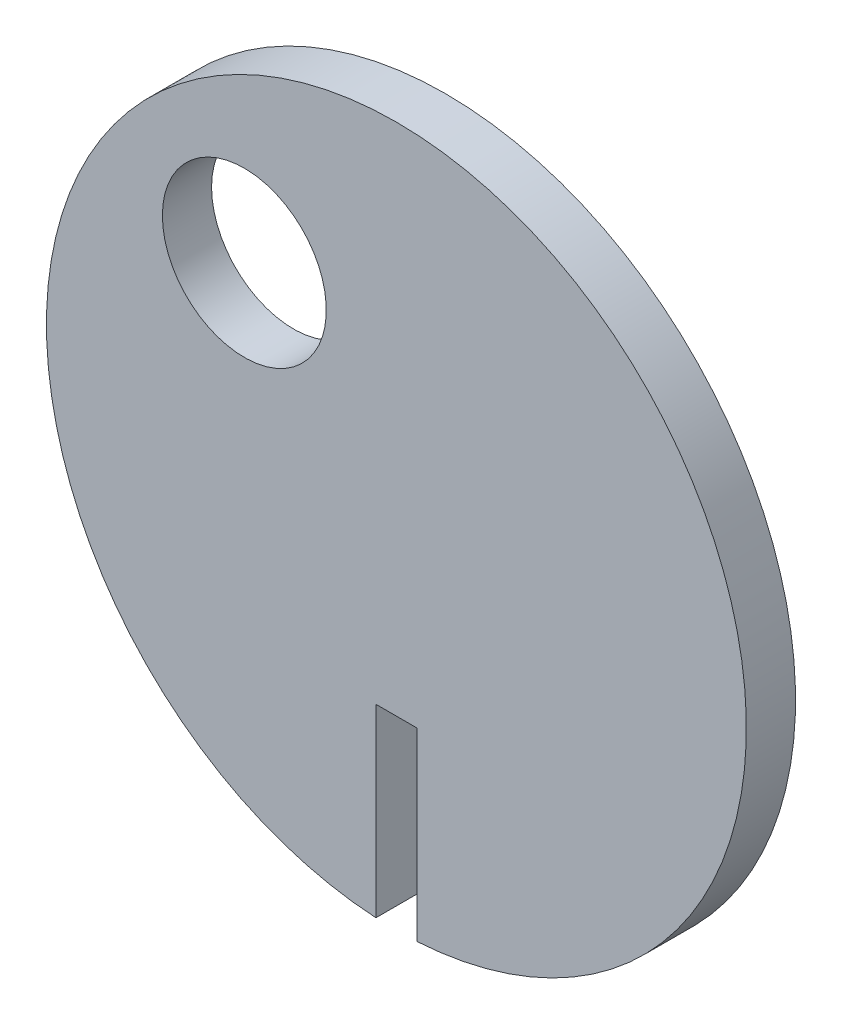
ISO-10303-21;
HEADER;
FILE_DESCRIPTION(('STEP AP214'),'2;1');
FILE_NAME('part.step','',(''),(''),'','','');
FILE_SCHEMA(('AUTOMOTIVE_DESIGN { 1 0 10303 214 1 1 1 1 }'));
ENDSEC;
DATA;
#1=APPLICATION_CONTEXT('core data for automotive mechanical design processes');
#2=APPLICATION_PROTOCOL_DEFINITION('international standard','automotive_design',2000,#1);
#3=PRODUCT_CONTEXT('',#1,'mechanical');
#4=PRODUCT('Part','Part','',(#3));
#5=PRODUCT_RELATED_PRODUCT_CATEGORY('part','',(#4));
#6=PRODUCT_DEFINITION_FORMATION('','',#4);
#7=PRODUCT_DEFINITION_CONTEXT('part definition',#1,'design');
#8=PRODUCT_DEFINITION('design','',#6,#7);
#9=PRODUCT_DEFINITION_SHAPE('','',#8);
#10=(LENGTH_UNIT() NAMED_UNIT(*) SI_UNIT(.MILLI.,.METRE.));
#11=(NAMED_UNIT(*) PLANE_ANGLE_UNIT() SI_UNIT($,.RADIAN.));
#12=(NAMED_UNIT(*) SI_UNIT($,.STERADIAN.) SOLID_ANGLE_UNIT());
#13=UNCERTAINTY_MEASURE_WITH_UNIT(LENGTH_MEASURE(1.E-05),#10,'distance_accuracy_value','');
#14=(GEOMETRIC_REPRESENTATION_CONTEXT(3) GLOBAL_UNCERTAINTY_ASSIGNED_CONTEXT((#13)) GLOBAL_UNIT_ASSIGNED_CONTEXT((#10,
#11,#12)) REPRESENTATION_CONTEXT('',''));
#15=CARTESIAN_POINT('',(0.,0.,0.));
#16=DIRECTION('',(0.,0.,1.));
#17=DIRECTION('',(1.,0.,0.));
#18=AXIS2_PLACEMENT_3D('',#15,#16,#17);
#19=CARTESIAN_POINT('',(0.,0.,3.81));
#20=DIRECTION('',(0.,0.,1.));
#21=DIRECTION('',(1.,0.,0.));
#22=AXIS2_PLACEMENT_3D('',#19,#20,#21);
#23=PLANE('',#22);
#24=CARTESIAN_POINT('',(-11.7820960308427,11.7820960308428,3.81));
#25=DIRECTION('',(0.,0.,1.));
#26=DIRECTION('',(1.,0.,0.));
#27=AXIS2_PLACEMENT_3D('',#24,#25,#26);
#28=CIRCLE('',#27,6.35);
#29=CARTESIAN_POINT('',(-18.1320960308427,11.7820960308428,3.81));
#30=VERTEX_POINT('',#29);
#31=EDGE_CURVE('E99',#30,#30,#28,.T.);
#32=ORIENTED_EDGE('',*,*,#31,.F.);
#33=EDGE_LOOP('',(#32));
#34=FACE_BOUND('',#33,.T.);
#35=CARTESIAN_POINT('',(0.,0.,3.81));
#36=DIRECTION('',(0.,0.,1.));
#37=DIRECTION('',(1.,0.,0.));
#38=AXIS2_PLACEMENT_3D('',#35,#36,#37);
#39=CIRCLE('',#38,27.1145);
#40=CARTESIAN_POINT('',(1.58750000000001,-27.0679876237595,3.81));
#41=VERTEX_POINT('',#40);
#42=CARTESIAN_POINT('',(-1.5875,-27.0679876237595,3.81));
#43=VERTEX_POINT('',#42);
#44=EDGE_CURVE('E103',#41,#43,#39,.T.);
#45=ORIENTED_EDGE('',*,*,#44,.T.);
#46=DIRECTION('',(0.,-1.,0.));
#47=VECTOR('',#46,1.);
#48=CARTESIAN_POINT('',(-1.5875,-12.7430596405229,3.81));
#49=LINE('',#48,#47);
#50=CARTESIAN_POINT('',(-1.5875,-12.7430596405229,3.81));
#51=VERTEX_POINT('',#50);
#52=EDGE_CURVE('E82',#51,#43,#49,.T.);
#53=ORIENTED_EDGE('',*,*,#52,.F.);
#54=DIRECTION('',(-1.,0.,0.));
#55=VECTOR('',#54,1.);
#56=CARTESIAN_POINT('',(-1.5875,-12.7430596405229,3.81));
#57=LINE('',#56,#55);
#58=CARTESIAN_POINT('',(1.58750000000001,-12.7430596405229,3.81));
#59=VERTEX_POINT('',#58);
#60=EDGE_CURVE('E94',#59,#51,#57,.T.);
#61=ORIENTED_EDGE('',*,*,#60,.F.);
#62=DIRECTION('',(0.,1.,0.));
#63=VECTOR('',#62,1.);
#64=CARTESIAN_POINT('',(1.58750000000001,-12.7430596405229,3.81));
#65=LINE('',#64,#63);
#66=EDGE_CURVE('E69',#41,#59,#65,.T.);
#67=ORIENTED_EDGE('',*,*,#66,.F.);
#68=EDGE_LOOP('',(#45,#53,#61,#67));
#69=FACE_BOUND('',#68,.T.);
#70=ADVANCED_FACE('F31',(#34,#69),#23,.T.);
#71=CARTESIAN_POINT('',(0.,0.,0.));
#72=DIRECTION('',(0.,0.,1.));
#73=DIRECTION('',(1.,0.,0.));
#74=AXIS2_PLACEMENT_3D('',#71,#72,#73);
#75=PLANE('',#74);
#76=CARTESIAN_POINT('',(-11.7820960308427,11.7820960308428,0.));
#77=DIRECTION('',(0.,0.,1.));
#78=DIRECTION('',(1.,0.,0.));
#79=AXIS2_PLACEMENT_3D('',#76,#77,#78);
#80=CIRCLE('',#79,6.35);
#81=CARTESIAN_POINT('',(-18.1320960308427,11.7820960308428,0.));
#82=VERTEX_POINT('',#81);
#83=EDGE_CURVE('E72',#82,#82,#80,.T.);
#84=ORIENTED_EDGE('',*,*,#83,.T.);
#85=EDGE_LOOP('',(#84));
#86=FACE_BOUND('',#85,.T.);
#87=DIRECTION('',(0.,-1.,0.));
#88=VECTOR('',#87,1.);
#89=CARTESIAN_POINT('',(-1.5875,-12.7430596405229,0.));
#90=LINE('',#89,#88);
#91=CARTESIAN_POINT('',(-1.5875,-12.7430596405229,0.));
#92=VERTEX_POINT('',#91);
#93=CARTESIAN_POINT('',(-1.5875,-27.0679876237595,0.));
#94=VERTEX_POINT('',#93);
#95=EDGE_CURVE('E88',#92,#94,#90,.T.);
#96=ORIENTED_EDGE('',*,*,#95,.T.);
#97=CARTESIAN_POINT('',(0.,0.,0.));
#98=DIRECTION('',(0.,0.,1.));
#99=DIRECTION('',(1.,0.,0.));
#100=AXIS2_PLACEMENT_3D('',#97,#98,#99);
#101=CIRCLE('',#100,27.1145);
#102=CARTESIAN_POINT('',(1.58750000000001,-27.0679876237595,0.));
#103=VERTEX_POINT('',#102);
#104=EDGE_CURVE('E87',#103,#94,#101,.T.);
#105=ORIENTED_EDGE('',*,*,#104,.F.);
#106=DIRECTION('',(0.,1.,0.));
#107=VECTOR('',#106,1.);
#108=CARTESIAN_POINT('',(1.58750000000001,-12.7430596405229,0.));
#109=LINE('',#108,#107);
#110=CARTESIAN_POINT('',(1.58750000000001,-12.7430596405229,0.));
#111=VERTEX_POINT('',#110);
#112=EDGE_CURVE('E46',#103,#111,#109,.T.);
#113=ORIENTED_EDGE('',*,*,#112,.T.);
#114=DIRECTION('',(-1.,0.,0.));
#115=VECTOR('',#114,1.);
#116=CARTESIAN_POINT('',(-1.5875,-12.7430596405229,0.));
#117=LINE('',#116,#115);
#118=EDGE_CURVE('E76',#111,#92,#117,.T.);
#119=ORIENTED_EDGE('',*,*,#118,.T.);
#120=EDGE_LOOP('',(#96,#105,#113,#119));
#121=FACE_BOUND('',#120,.T.);
#122=ADVANCED_FACE('F85',(#86,#121),#75,.F.);
#123=CARTESIAN_POINT('',(0.,0.,3.81));
#124=DIRECTION('',(0.,0.,-1.));
#125=DIRECTION('',(-1.,0.,0.));
#126=AXIS2_PLACEMENT_3D('',#123,#124,#125);
#127=CYLINDRICAL_SURFACE('',#126,27.1145);
#128=DIRECTION('',(0.,0.,-1.));
#129=VECTOR('',#128,1.);
#130=CARTESIAN_POINT('',(-1.58749999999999,-27.0679876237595,3.81));
#131=LINE('',#130,#129);
#132=EDGE_CURVE('E11',#43,#94,#131,.T.);
#133=ORIENTED_EDGE('',*,*,#132,.F.);
#134=ORIENTED_EDGE('',*,*,#44,.F.);
#135=DIRECTION('',(0.,0.,-1.));
#136=VECTOR('',#135,1.);
#137=CARTESIAN_POINT('',(1.5875,-27.0679876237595,3.81));
#138=LINE('',#137,#136);
#139=EDGE_CURVE('E39',#103,#41,#138,.F.);
#140=ORIENTED_EDGE('',*,*,#139,.F.);
#141=ORIENTED_EDGE('',*,*,#104,.T.);
#142=EDGE_LOOP('',(#133,#134,#140,#141));
#143=FACE_BOUND('',#142,.T.);
#144=ADVANCED_FACE('F33',(#143),#127,.T.);
#145=CARTESIAN_POINT('',(-11.7820960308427,11.7820960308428,3.81));
#146=DIRECTION('',(0.,0.,-1.));
#147=DIRECTION('',(-1.,0.,0.));
#148=AXIS2_PLACEMENT_3D('',#145,#146,#147);
#149=CYLINDRICAL_SURFACE('',#148,6.35);
#150=CARTESIAN_POINT('',(-18.1320960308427,11.7820960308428,3.81));
#151=CARTESIAN_POINT('',(-18.1320960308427,11.7820960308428,3.7703125));
#152=CARTESIAN_POINT('',(-18.1320960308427,11.7820960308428,3.730625));
#153=CARTESIAN_POINT('',(-18.1320960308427,11.7820960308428,3.65125));
#154=CARTESIAN_POINT('',(-18.1320960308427,11.7820960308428,3.6115625));
#155=CARTESIAN_POINT('',(-18.1320960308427,11.7820960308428,3.5321875));
#156=CARTESIAN_POINT('',(-18.1320960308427,11.7820960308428,3.4925));
#157=CARTESIAN_POINT('',(-18.1320960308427,11.7820960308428,3.413125));
#158=CARTESIAN_POINT('',(-18.1320960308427,11.7820960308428,3.3734375));
#159=CARTESIAN_POINT('',(-18.1320960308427,11.7820960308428,3.2940625));
#160=CARTESIAN_POINT('',(-18.1320960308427,11.7820960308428,3.254375));
#161=CARTESIAN_POINT('',(-18.1320960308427,11.7820960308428,3.175));
#162=CARTESIAN_POINT('',(-18.1320960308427,11.7820960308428,3.1353125));
#163=CARTESIAN_POINT('',(-18.1320960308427,11.7820960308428,3.0559375));
#164=CARTESIAN_POINT('',(-18.1320960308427,11.7820960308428,3.01625));
#165=CARTESIAN_POINT('',(-18.1320960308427,11.7820960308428,2.936875));
#166=CARTESIAN_POINT('',(-18.1320960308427,11.7820960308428,2.8971875));
#167=CARTESIAN_POINT('',(-18.1320960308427,11.7820960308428,2.8178125));
#168=CARTESIAN_POINT('',(-18.1320960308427,11.7820960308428,2.778125));
#169=CARTESIAN_POINT('',(-18.1320960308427,11.7820960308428,2.69875));
#170=CARTESIAN_POINT('',(-18.1320960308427,11.7820960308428,2.6590625));
#171=CARTESIAN_POINT('',(-18.1320960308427,11.7820960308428,2.5796875));
#172=CARTESIAN_POINT('',(-18.1320960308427,11.7820960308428,2.54));
#173=CARTESIAN_POINT('',(-18.1320960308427,11.7820960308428,2.460625));
#174=CARTESIAN_POINT('',(-18.1320960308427,11.7820960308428,2.4209375));
#175=CARTESIAN_POINT('',(-18.1320960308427,11.7820960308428,2.3415625));
#176=CARTESIAN_POINT('',(-18.1320960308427,11.7820960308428,2.301875));
#177=CARTESIAN_POINT('',(-18.1320960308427,11.7820960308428,2.2225));
#178=CARTESIAN_POINT('',(-18.1320960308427,11.7820960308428,2.1828125));
#179=CARTESIAN_POINT('',(-18.1320960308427,11.7820960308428,2.1034375));
#180=CARTESIAN_POINT('',(-18.1320960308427,11.7820960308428,2.06375));
#181=CARTESIAN_POINT('',(-18.1320960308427,11.7820960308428,1.984375));
#182=CARTESIAN_POINT('',(-18.1320960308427,11.7820960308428,1.9446875));
#183=CARTESIAN_POINT('',(-18.1320960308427,11.7820960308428,1.8653125));
#184=CARTESIAN_POINT('',(-18.1320960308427,11.7820960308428,1.825625));
#185=CARTESIAN_POINT('',(-18.1320960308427,11.7820960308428,1.74625));
#186=CARTESIAN_POINT('',(-18.1320960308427,11.7820960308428,1.7065625));
#187=CARTESIAN_POINT('',(-18.1320960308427,11.7820960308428,1.6271875));
#188=CARTESIAN_POINT('',(-18.1320960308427,11.7820960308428,1.5875));
#189=CARTESIAN_POINT('',(-18.1320960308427,11.7820960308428,1.508125));
#190=CARTESIAN_POINT('',(-18.1320960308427,11.7820960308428,1.4684375));
#191=CARTESIAN_POINT('',(-18.1320960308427,11.7820960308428,1.3890625));
#192=CARTESIAN_POINT('',(-18.1320960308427,11.7820960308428,1.349375));
#193=CARTESIAN_POINT('',(-18.1320960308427,11.7820960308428,1.27));
#194=CARTESIAN_POINT('',(-18.1320960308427,11.7820960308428,1.2303125));
#195=CARTESIAN_POINT('',(-18.1320960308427,11.7820960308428,1.1509375));
#196=CARTESIAN_POINT('',(-18.1320960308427,11.7820960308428,1.11125));
#197=CARTESIAN_POINT('',(-18.1320960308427,11.7820960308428,1.031875));
#198=CARTESIAN_POINT('',(-18.1320960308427,11.7820960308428,0.9921875));
#199=CARTESIAN_POINT('',(-18.1320960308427,11.7820960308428,0.9128125));
#200=CARTESIAN_POINT('',(-18.1320960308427,11.7820960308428,0.873125));
#201=CARTESIAN_POINT('',(-18.1320960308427,11.7820960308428,0.79375));
#202=CARTESIAN_POINT('',(-18.1320960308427,11.7820960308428,0.7540625));
#203=CARTESIAN_POINT('',(-18.1320960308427,11.7820960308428,0.6746875));
#204=CARTESIAN_POINT('',(-18.1320960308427,11.7820960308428,0.635));
#205=CARTESIAN_POINT('',(-18.1320960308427,11.7820960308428,0.555625));
#206=CARTESIAN_POINT('',(-18.1320960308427,11.7820960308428,0.5159375));
#207=CARTESIAN_POINT('',(-18.1320960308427,11.7820960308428,0.4365625));
#208=CARTESIAN_POINT('',(-18.1320960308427,11.7820960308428,0.396875));
#209=CARTESIAN_POINT('',(-18.1320960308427,11.7820960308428,0.3175));
#210=CARTESIAN_POINT('',(-18.1320960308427,11.7820960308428,0.2778125));
#211=CARTESIAN_POINT('',(-18.1320960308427,11.7820960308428,0.1984375));
#212=CARTESIAN_POINT('',(-18.1320960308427,11.7820960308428,0.15875));
#213=CARTESIAN_POINT('',(-18.1320960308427,11.7820960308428,0.0793749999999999));
#214=CARTESIAN_POINT('',(-18.1320960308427,11.7820960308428,0.0396874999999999));
#215=CARTESIAN_POINT('',(-18.1320960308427,11.7820960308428,0.));
#216=B_SPLINE_CURVE_WITH_KNOTS('',3,(#150,#151,#152,#153,#154,#155,#156,#157,#158,#159,#160,
#161,#162,#163,#164,#165,#166,#167,#168,#169,#170,#171,#172,#173,#174,#175,#176,#177,#178,#179,
#180,#181,#182,#183,#184,#185,#186,#187,#188,#189,#190,#191,#192,#193,#194,#195,#196,#197,#198,
#199,#200,#201,#202,#203,#204,#205,#206,#207,#208,#209,#210,#211,#212,#213,#214,#215),
.UNSPECIFIED.,.F.,.F.,(4,2,2,2,2,2,2,2,2,2,2,2,2,2,2,2,2,2,2,2,2,2,2,2,2,2,2,2,2,2,2,2,4),(0.,
0.1190625,0.238125,0.3571875,0.47625,0.5953125,0.714375,0.8334375,0.9525,1.0715625,1.190625,
1.3096875,1.42875,1.5478125,1.666875,1.7859375,1.905,2.0240625,2.143125,2.2621875,2.38125,
2.5003125,2.619375,2.7384375,2.8575,2.9765625,3.095625,3.2146875,3.33375,3.4528125,3.571875,
3.6909375,3.81),.UNSPECIFIED.);
#217=EDGE_CURVE('BSEAM113',#30,#82,#216,.T.);
#218=ORIENTED_EDGE('',*,*,#31,.T.);
#219=ORIENTED_EDGE('',*,*,#83,.F.);
#220=ORIENTED_EDGE('',*,*,#217,.T.);
#221=ORIENTED_EDGE('',*,*,#217,.F.);
#222=EDGE_LOOP('',(#218,#220,#219,#221));
#223=FACE_BOUND('',#222,.T.);
#224=ADVANCED_FACE('F113',(#223),#149,.F.);
#225=CARTESIAN_POINT('',(-1.5875,-12.7430596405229,3.81));
#226=DIRECTION('',(1.,0.,0.));
#227=DIRECTION('',(0.,0.,-1.));
#228=AXIS2_PLACEMENT_3D('',#225,#226,#227);
#229=PLANE('',#228);
#230=ORIENTED_EDGE('',*,*,#132,.T.);
#231=ORIENTED_EDGE('',*,*,#95,.F.);
#232=DIRECTION('',(0.,0.,-1.));
#233=VECTOR('',#232,1.);
#234=CARTESIAN_POINT('',(-1.5875,-12.7430596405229,3.81));
#235=LINE('',#234,#233);
#236=EDGE_CURVE('E73',#51,#92,#235,.T.);
#237=ORIENTED_EDGE('',*,*,#236,.F.);
#238=ORIENTED_EDGE('',*,*,#52,.T.);
#239=EDGE_LOOP('',(#230,#231,#237,#238));
#240=FACE_BOUND('',#239,.T.);
#241=ADVANCED_FACE('F111',(#240),#229,.T.);
#242=CARTESIAN_POINT('',(1.58750000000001,-12.7430596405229,3.81));
#243=DIRECTION('',(-1.,0.,0.));
#244=DIRECTION('',(0.,0.,1.));
#245=AXIS2_PLACEMENT_3D('',#242,#243,#244);
#246=PLANE('',#245);
#247=ORIENTED_EDGE('',*,*,#139,.T.);
#248=ORIENTED_EDGE('',*,*,#66,.T.);
#249=DIRECTION('',(0.,0.,-1.));
#250=VECTOR('',#249,1.);
#251=CARTESIAN_POINT('',(1.58750000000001,-12.7430596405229,3.81));
#252=LINE('',#251,#250);
#253=EDGE_CURVE('E66',#59,#111,#252,.T.);
#254=ORIENTED_EDGE('',*,*,#253,.T.);
#255=ORIENTED_EDGE('',*,*,#112,.F.);
#256=EDGE_LOOP('',(#247,#248,#254,#255));
#257=FACE_BOUND('',#256,.T.);
#258=ADVANCED_FACE('F68',(#257),#246,.T.);
#259=CARTESIAN_POINT('',(-1.5875,-12.7430596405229,3.81));
#260=DIRECTION('',(0.,-1.,0.));
#261=DIRECTION('',(0.,0.,-1.));
#262=AXIS2_PLACEMENT_3D('',#259,#260,#261);
#263=PLANE('',#262);
#264=ORIENTED_EDGE('',*,*,#118,.F.);
#265=ORIENTED_EDGE('',*,*,#253,.F.);
#266=ORIENTED_EDGE('',*,*,#60,.T.);
#267=ORIENTED_EDGE('',*,*,#236,.T.);
#268=EDGE_LOOP('',(#264,#265,#266,#267));
#269=FACE_BOUND('',#268,.T.);
#270=ADVANCED_FACE('F77',(#269),#263,.T.);
#271=CLOSED_SHELL('',(#70,#122,#144,#224,#241,#258,#270));
#272=MANIFOLD_SOLID_BREP('B2',#271);
#273=ADVANCED_BREP_SHAPE_REPRESENTATION('',(#18,#272),#14);
#274=SHAPE_DEFINITION_REPRESENTATION(#9,#273);
ENDSEC;
END-ISO-10303-21;
